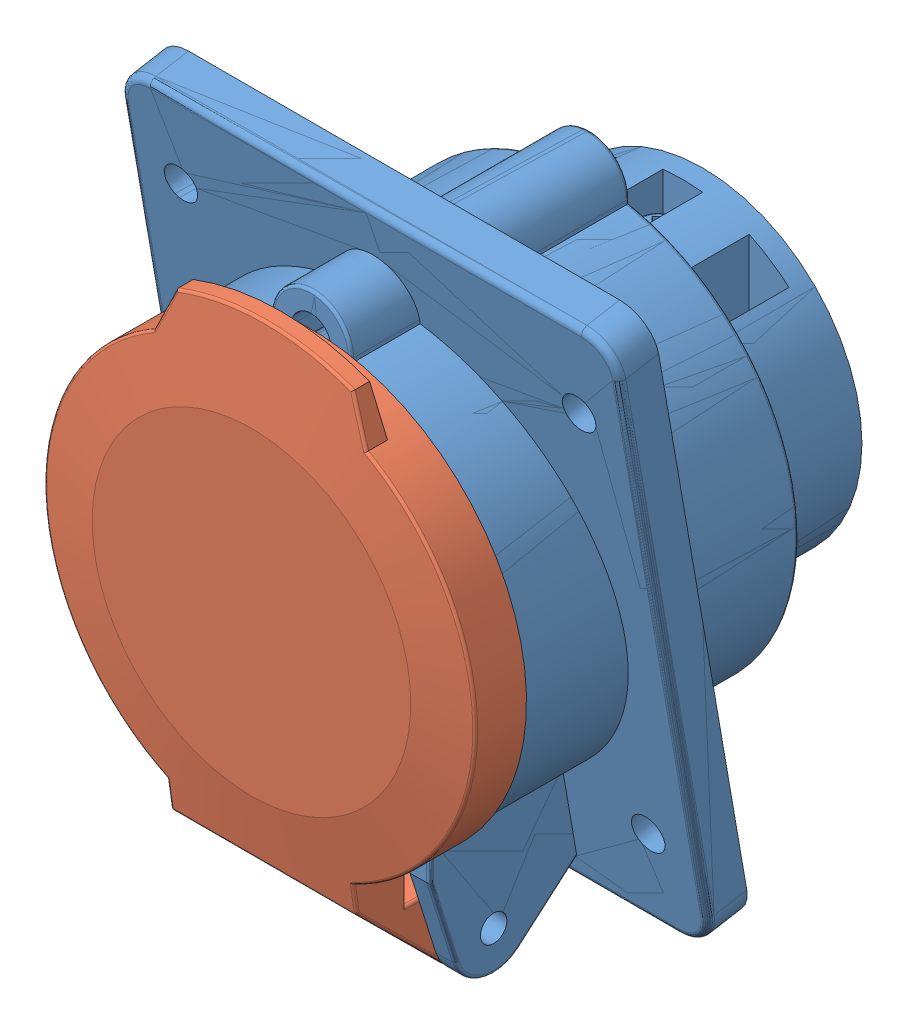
SolidWorks assembly Сборка 414-16.SLDASM, configuration По умолчанию (file format 10000). Lengths in mm.
Overall size (75 93.5 83).
2 component instances, 2 part files, 3 mates.
Components (placement in the parent):
- Корпус 414-1: Корпус 414.SLDPRT [По умолчанию] at (70.0989 47.7654 40.3199) size (75 93.5 74.02)
- Крышка 415, 414, 413-1: Крышка 415, 414, 413.SLDPRT [По умолчанию] at (70.0989 47.7654 91.3199) x (0 -1 0) z (0 0 -1) size (85 64.9 25)
Mates (geometry in assembly coordinates):
- Концентричный1: concentric anti-aligned: cylinder of Корпус 414-1 through (70.0989 47.7654 82.3199) axis (0 0 -1) radius 31.5; cylinder of Крышка 415, 414, 413-1 through (70.0989 47.7654 68.3199) axis (0 0 1) radius 32.4495
- Параллельность1: parallel aligned: plane of Корпус 414-1 through (84.5989 19.8011 64.8199) normal (-1 0 0); plane of Крышка 415, 414, 413-1 through (56.0989 5.7654 72.3199) normal (-1 0 0)
- Совпадение1: coincident anti-aligned: plane of Корпус 414-1 through (70.0989 47.7654 82.3199) normal (0 0 1); plane of Крышка 415, 414, 413-1 through (70.0989 47.7654 82.3199) normal (0 0 -1)
